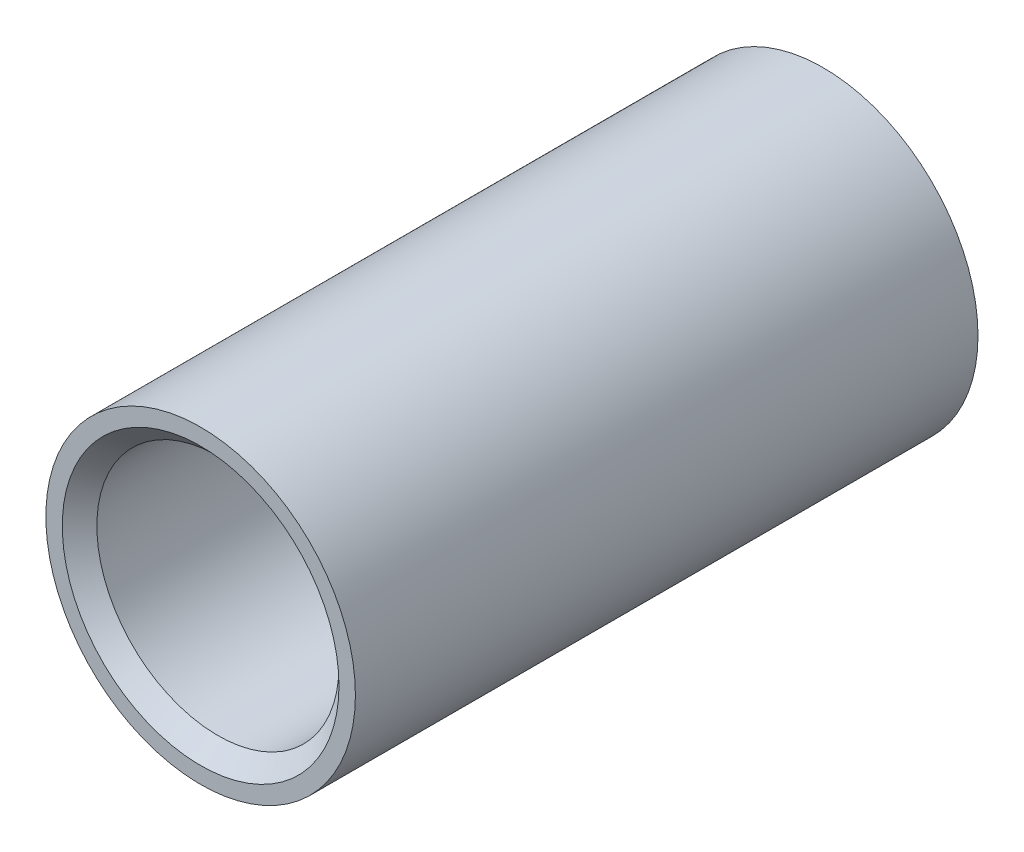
ISO-10303-21;
HEADER;
FILE_DESCRIPTION(('STEP AP214'),'2;1');
FILE_NAME('part.step','',(''),(''),'','','');
FILE_SCHEMA(('AUTOMOTIVE_DESIGN { 1 0 10303 214 1 1 1 1 }'));
ENDSEC;
DATA;
#1=APPLICATION_CONTEXT('core data for automotive mechanical design processes');
#2=APPLICATION_PROTOCOL_DEFINITION('international standard','automotive_design',2000,#1);
#3=PRODUCT_CONTEXT('',#1,'mechanical');
#4=PRODUCT('Part','Part','',(#3));
#5=PRODUCT_RELATED_PRODUCT_CATEGORY('part','',(#4));
#6=PRODUCT_DEFINITION_FORMATION('','',#4);
#7=PRODUCT_DEFINITION_CONTEXT('part definition',#1,'design');
#8=PRODUCT_DEFINITION('design','',#6,#7);
#9=PRODUCT_DEFINITION_SHAPE('','',#8);
#10=(LENGTH_UNIT() NAMED_UNIT(*) SI_UNIT(.MILLI.,.METRE.));
#11=(NAMED_UNIT(*) PLANE_ANGLE_UNIT() SI_UNIT($,.RADIAN.));
#12=(NAMED_UNIT(*) SI_UNIT($,.STERADIAN.) SOLID_ANGLE_UNIT());
#13=UNCERTAINTY_MEASURE_WITH_UNIT(LENGTH_MEASURE(1.E-05),#10,'distance_accuracy_value','');
#14=(GEOMETRIC_REPRESENTATION_CONTEXT(3) GLOBAL_UNCERTAINTY_ASSIGNED_CONTEXT((#13)) GLOBAL_UNIT_ASSIGNED_CONTEXT((#10,
#11,#12)) REPRESENTATION_CONTEXT('',''));
#15=CARTESIAN_POINT('',(0.,0.,0.));
#16=DIRECTION('',(0.,0.,1.));
#17=DIRECTION('',(1.,0.,0.));
#18=AXIS2_PLACEMENT_3D('',#15,#16,#17);
#19=CARTESIAN_POINT('',(-7.5,0.,53.4999996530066));
#20=DIRECTION('',(0.,0.,1.));
#21=DIRECTION('',(1.,0.,0.));
#22=AXIS2_PLACEMENT_3D('',#19,#20,#21);
#23=CONICAL_SURFACE('',#22,3.50000172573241,0.785398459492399);
#24=CARTESIAN_POINT('',(-7.5,0.,53.50000137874));
#25=DIRECTION('',(0.,0.,1.));
#26=DIRECTION('',(1.,0.,0.));
#27=AXIS2_PLACEMENT_3D('',#24,#25,#26);
#28=CIRCLE('',#27,3.5);
#29=CARTESIAN_POINT('',(-4.,0.,53.50000137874));
#30=VERTEX_POINT('',#29);
#31=EDGE_CURVE('E30',#30,#30,#28,.F.);
#32=ORIENTED_EDGE('',*,*,#31,.T.);
#33=EDGE_LOOP('',(#32));
#34=FACE_BOUND('',#33,.T.);
#35=CARTESIAN_POINT('',(-7.5,0.,54.));
#36=DIRECTION('',(0.,0.,1.));
#37=DIRECTION('',(1.,0.,0.));
#38=AXIS2_PLACEMENT_3D('',#35,#36,#37);
#39=CIRCLE('',#38,4.00000236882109);
#40=CARTESIAN_POINT('',(-3.49999763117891,0.,54.));
#41=VERTEX_POINT('',#40);
#42=EDGE_CURVE('E18',#41,#41,#39,.T.);
#43=ORIENTED_EDGE('',*,*,#42,.T.);
#44=EDGE_LOOP('',(#43));
#45=FACE_BOUND('',#44,.T.);
#46=ADVANCED_FACE('F14',(#34,#45),#23,.F.);
#47=CARTESIAN_POINT('',(-12.154,-4.654,54.));
#48=DIRECTION('',(0.,0.,1.));
#49=DIRECTION('',(1.,0.,0.));
#50=AXIS2_PLACEMENT_3D('',#47,#48,#49);
#51=PLANE('',#50);
#52=ORIENTED_EDGE('',*,*,#42,.F.);
#53=EDGE_LOOP('',(#52));
#54=FACE_BOUND('',#53,.T.);
#55=CARTESIAN_POINT('',(-7.5,0.,54.));
#56=DIRECTION('',(0.,0.,1.));
#57=DIRECTION('',(1.,0.,0.));
#58=AXIS2_PLACEMENT_3D('',#55,#56,#57);
#59=CIRCLE('',#58,4.475);
#60=CARTESIAN_POINT('',(-3.025,0.,54.));
#61=VERTEX_POINT('',#60);
#62=EDGE_CURVE('E32',#61,#61,#59,.T.);
#63=ORIENTED_EDGE('',*,*,#62,.T.);
#64=EDGE_LOOP('',(#63));
#65=FACE_BOUND('',#64,.T.);
#66=ADVANCED_FACE('F44',(#54,#65),#51,.T.);
#67=CARTESIAN_POINT('',(-7.5,0.,36.49999862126));
#68=DIRECTION('',(0.,0.,1.));
#69=DIRECTION('',(1.,0.,0.));
#70=AXIS2_PLACEMENT_3D('',#67,#68,#69);
#71=CYLINDRICAL_SURFACE('',#70,3.5);
#72=CARTESIAN_POINT('',(-7.5,0.,36.5000003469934));
#73=DIRECTION('',(0.,0.,-1.));
#74=DIRECTION('',(0.,-1.,0.));
#75=AXIS2_PLACEMENT_3D('',#72,#73,#74);
#76=CIRCLE('',#75,3.5000017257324);
#77=CARTESIAN_POINT('',(-7.5,-3.5000017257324,36.5000003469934));
#78=VERTEX_POINT('',#77);
#79=EDGE_CURVE('E27',#78,#78,#76,.T.);
#80=ORIENTED_EDGE('',*,*,#79,.T.);
#81=EDGE_LOOP('',(#80));
#82=FACE_BOUND('',#81,.T.);
#83=ORIENTED_EDGE('',*,*,#31,.F.);
#84=EDGE_LOOP('',(#83));
#85=FACE_BOUND('',#84,.T.);
#86=ADVANCED_FACE('F46',(#82,#85),#71,.F.);
#87=CARTESIAN_POINT('',(-7.5,0.,36.));
#88=DIRECTION('',(0.,0.,1.));
#89=DIRECTION('',(1.,0.,0.));
#90=AXIS2_PLACEMENT_3D('',#87,#88,#89);
#91=CYLINDRICAL_SURFACE('',#90,4.475);
#92=ORIENTED_EDGE('',*,*,#62,.F.);
#93=EDGE_LOOP('',(#92));
#94=FACE_BOUND('',#93,.T.);
#95=CARTESIAN_POINT('',(-7.5,0.,36.));
#96=DIRECTION('',(0.,0.,1.));
#97=DIRECTION('',(1.,0.,0.));
#98=AXIS2_PLACEMENT_3D('',#95,#96,#97);
#99=CIRCLE('',#98,4.475);
#100=CARTESIAN_POINT('',(-3.025,0.,36.));
#101=VERTEX_POINT('',#100);
#102=EDGE_CURVE('E22',#101,#101,#99,.T.);
#103=ORIENTED_EDGE('',*,*,#102,.T.);
#104=EDGE_LOOP('',(#103));
#105=FACE_BOUND('',#104,.T.);
#106=ADVANCED_FACE('F52',(#94,#105),#91,.T.);
#107=CARTESIAN_POINT('',(-7.5,0.,36.5000003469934));
#108=DIRECTION('',(0.,0.,-1.));
#109=DIRECTION('',(-1.,0.,0.));
#110=AXIS2_PLACEMENT_3D('',#107,#108,#109);
#111=CONICAL_SURFACE('',#110,3.5000017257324,0.785398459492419);
#112=ORIENTED_EDGE('',*,*,#79,.F.);
#113=EDGE_LOOP('',(#112));
#114=FACE_BOUND('',#113,.T.);
#115=CARTESIAN_POINT('',(-7.5,0.,36.));
#116=DIRECTION('',(0.,0.,1.));
#117=DIRECTION('',(1.,0.,0.));
#118=AXIS2_PLACEMENT_3D('',#115,#116,#117);
#119=CIRCLE('',#118,4.00000236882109);
#120=CARTESIAN_POINT('',(-3.49999763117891,0.,36.));
#121=VERTEX_POINT('',#120);
#122=EDGE_CURVE('E9',#121,#121,#119,.F.);
#123=ORIENTED_EDGE('',*,*,#122,.T.);
#124=EDGE_LOOP('',(#123));
#125=FACE_BOUND('',#124,.T.);
#126=ADVANCED_FACE('F57',(#114,#125),#111,.F.);
#127=CARTESIAN_POINT('',(-12.154,-4.654,36.));
#128=DIRECTION('',(0.,0.,1.));
#129=DIRECTION('',(1.,0.,0.));
#130=AXIS2_PLACEMENT_3D('',#127,#128,#129);
#131=PLANE('',#130);
#132=ORIENTED_EDGE('',*,*,#122,.F.);
#133=EDGE_LOOP('',(#132));
#134=FACE_BOUND('',#133,.T.);
#135=ORIENTED_EDGE('',*,*,#102,.F.);
#136=EDGE_LOOP('',(#135));
#137=FACE_BOUND('',#136,.T.);
#138=ADVANCED_FACE('F16',(#134,#137),#131,.F.);
#139=CLOSED_SHELL('',(#46,#66,#86,#106,#126,#138));
#140=MANIFOLD_SOLID_BREP('B1',#139);
#141=ADVANCED_BREP_SHAPE_REPRESENTATION('',(#18,#140),#14);
#142=SHAPE_DEFINITION_REPRESENTATION(#9,#141);
ENDSEC;
END-ISO-10303-21;
